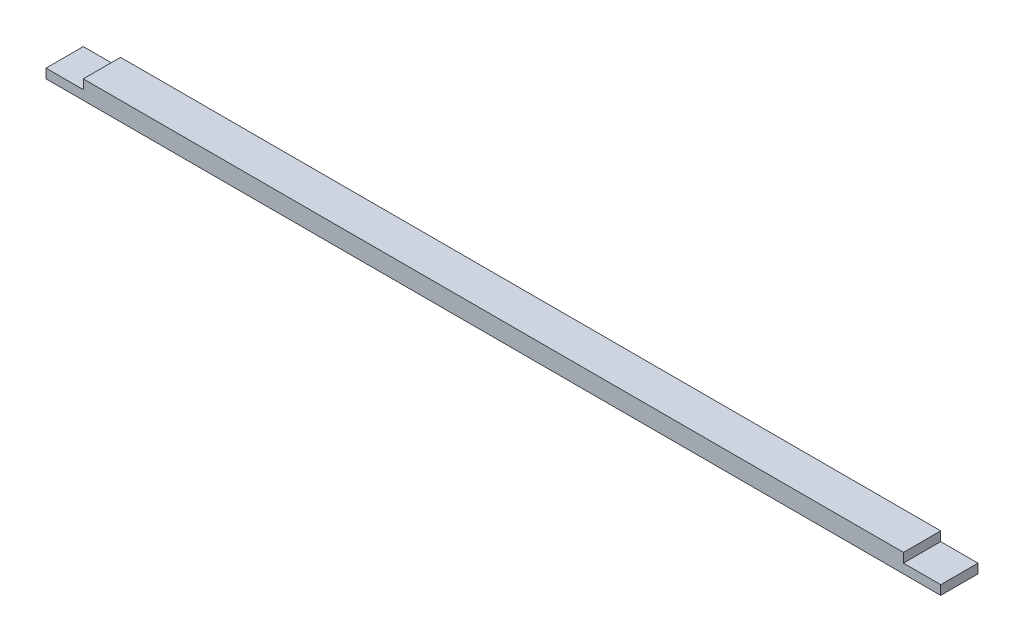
ISO-10303-21;
HEADER;
FILE_DESCRIPTION(('STEP AP214'),'2;1');
FILE_NAME('part.step','',(''),(''),'','','');
FILE_SCHEMA(('AUTOMOTIVE_DESIGN { 1 0 10303 214 1 1 1 1 }'));
ENDSEC;
DATA;
#1=APPLICATION_CONTEXT('core data for automotive mechanical design processes');
#2=APPLICATION_PROTOCOL_DEFINITION('international standard','automotive_design',2000,#1);
#3=PRODUCT_CONTEXT('',#1,'mechanical');
#4=PRODUCT('Part','Part','',(#3));
#5=PRODUCT_RELATED_PRODUCT_CATEGORY('part','',(#4));
#6=PRODUCT_DEFINITION_FORMATION('','',#4);
#7=PRODUCT_DEFINITION_CONTEXT('part definition',#1,'design');
#8=PRODUCT_DEFINITION('design','',#6,#7);
#9=PRODUCT_DEFINITION_SHAPE('','',#8);
#10=(LENGTH_UNIT() NAMED_UNIT(*) SI_UNIT(.MILLI.,.METRE.));
#11=(NAMED_UNIT(*) PLANE_ANGLE_UNIT() SI_UNIT($,.RADIAN.));
#12=(NAMED_UNIT(*) SI_UNIT($,.STERADIAN.) SOLID_ANGLE_UNIT());
#13=UNCERTAINTY_MEASURE_WITH_UNIT(LENGTH_MEASURE(1.E-05),#10,'distance_accuracy_value','');
#14=(GEOMETRIC_REPRESENTATION_CONTEXT(3) GLOBAL_UNCERTAINTY_ASSIGNED_CONTEXT((#13)) GLOBAL_UNIT_ASSIGNED_CONTEXT((#10,
#11,#12)) REPRESENTATION_CONTEXT('',''));
#15=CARTESIAN_POINT('',(0.,0.,0.));
#16=DIRECTION('',(0.,0.,1.));
#17=DIRECTION('',(1.,0.,0.));
#18=AXIS2_PLACEMENT_3D('',#15,#16,#17);
#19=CARTESIAN_POINT('',(-1219.2,50.8,1168.4));
#20=DIRECTION('',(0.,0.,1.));
#21=DIRECTION('',(1.,0.,0.));
#22=AXIS2_PLACEMENT_3D('',#19,#20,#21);
#23=PLANE('',#22);
#24=DIRECTION('',(0.,1.,0.));
#25=VECTOR('',#24,1.);
#26=CARTESIAN_POINT('',(-1117.6,25.4,1168.4));
#27=LINE('',#26,#25);
#28=CARTESIAN_POINT('',(-1117.6,25.4,1168.4));
#29=VERTEX_POINT('',#28);
#30=CARTESIAN_POINT('',(-1117.6,50.8,1168.4));
#31=VERTEX_POINT('',#30);
#32=EDGE_CURVE('E169',#29,#31,#27,.T.);
#33=ORIENTED_EDGE('',*,*,#32,.T.);
#34=DIRECTION('',(-1.,0.,0.));
#35=VECTOR('',#34,1.);
#36=CARTESIAN_POINT('',(-1219.2,50.8,1168.4));
#37=LINE('',#36,#35);
#38=CARTESIAN_POINT('',(1117.6,50.8,1168.4));
#39=VERTEX_POINT('',#38);
#40=EDGE_CURVE('E142',#39,#31,#37,.T.);
#41=ORIENTED_EDGE('',*,*,#40,.F.);
#42=DIRECTION('',(0.,1.,0.));
#43=VECTOR('',#42,1.);
#44=CARTESIAN_POINT('',(1117.6,25.4,1168.4));
#45=LINE('',#44,#43);
#46=CARTESIAN_POINT('',(1117.6,25.4,1168.4));
#47=VERTEX_POINT('',#46);
#48=EDGE_CURVE('E63',#47,#39,#45,.T.);
#49=ORIENTED_EDGE('',*,*,#48,.F.);
#50=DIRECTION('',(-1.,0.,0.));
#51=VECTOR('',#50,1.);
#52=CARTESIAN_POINT('',(1219.2,25.4,1168.4));
#53=LINE('',#52,#51);
#54=CARTESIAN_POINT('',(1219.2,25.4,1168.4));
#55=VERTEX_POINT('',#54);
#56=EDGE_CURVE('E176',#55,#47,#53,.T.);
#57=ORIENTED_EDGE('',*,*,#56,.F.);
#58=DIRECTION('',(0.,-1.,0.));
#59=VECTOR('',#58,1.);
#60=CARTESIAN_POINT('',(1219.2,50.8,1168.4));
#61=LINE('',#60,#59);
#62=CARTESIAN_POINT('',(1219.2,0.,1168.4));
#63=VERTEX_POINT('',#62);
#64=EDGE_CURVE('E11',#55,#63,#61,.T.);
#65=ORIENTED_EDGE('',*,*,#64,.T.);
#66=DIRECTION('',(-1.,0.,0.));
#67=VECTOR('',#66,1.);
#68=CARTESIAN_POINT('',(-1219.2,0.,1168.4));
#69=LINE('',#68,#67);
#70=CARTESIAN_POINT('',(-1219.2,0.,1168.4));
#71=VERTEX_POINT('',#70);
#72=EDGE_CURVE('E145',#63,#71,#69,.T.);
#73=ORIENTED_EDGE('',*,*,#72,.T.);
#74=DIRECTION('',(0.,-1.,0.));
#75=VECTOR('',#74,1.);
#76=CARTESIAN_POINT('',(-1219.2,50.8,1168.4));
#77=LINE('',#76,#75);
#78=CARTESIAN_POINT('',(-1219.2,25.4,1168.4));
#79=VERTEX_POINT('',#78);
#80=EDGE_CURVE('E48',#79,#71,#77,.T.);
#81=ORIENTED_EDGE('',*,*,#80,.F.);
#82=DIRECTION('',(1.,0.,0.));
#83=VECTOR('',#82,1.);
#84=CARTESIAN_POINT('',(-1219.2,25.4,1168.4));
#85=LINE('',#84,#83);
#86=EDGE_CURVE('E111',#79,#29,#85,.T.);
#87=ORIENTED_EDGE('',*,*,#86,.T.);
#88=EDGE_LOOP('',(#33,#41,#49,#57,#65,#73,#81,#87));
#89=FACE_BOUND('',#88,.T.);
#90=ADVANCED_FACE('F39',(#89),#23,.F.);
#91=CARTESIAN_POINT('',(-1219.2,50.8,1168.4));
#92=DIRECTION('',(1.,0.,0.));
#93=DIRECTION('',(0.,0.,-1.));
#94=AXIS2_PLACEMENT_3D('',#91,#92,#93);
#95=PLANE('',#94);
#96=DIRECTION('',(0.,0.,-1.));
#97=VECTOR('',#96,1.);
#98=CARTESIAN_POINT('',(-1219.2,25.4,1270.));
#99=LINE('',#98,#97);
#100=CARTESIAN_POINT('',(-1219.2,25.4,1270.));
#101=VERTEX_POINT('',#100);
#102=EDGE_CURVE('E105',#101,#79,#99,.T.);
#103=ORIENTED_EDGE('',*,*,#102,.T.);
#104=ORIENTED_EDGE('',*,*,#80,.T.);
#105=DIRECTION('',(0.,0.,1.));
#106=VECTOR('',#105,1.);
#107=CARTESIAN_POINT('',(-1219.2,0.,1168.4));
#108=LINE('',#107,#106);
#109=CARTESIAN_POINT('',(-1219.2,0.,1270.));
#110=VERTEX_POINT('',#109);
#111=EDGE_CURVE('E129',#71,#110,#108,.T.);
#112=ORIENTED_EDGE('',*,*,#111,.T.);
#113=DIRECTION('',(0.,-1.,0.));
#114=VECTOR('',#113,1.);
#115=CARTESIAN_POINT('',(-1219.2,50.8,1270.));
#116=LINE('',#115,#114);
#117=EDGE_CURVE('E121',#101,#110,#116,.T.);
#118=ORIENTED_EDGE('',*,*,#117,.F.);
#119=EDGE_LOOP('',(#103,#104,#112,#118));
#120=FACE_BOUND('',#119,.T.);
#121=ADVANCED_FACE('F127',(#120),#95,.F.);
#122=CARTESIAN_POINT('',(-1219.2,50.8,1270.));
#123=DIRECTION('',(0.,0.,-1.));
#124=DIRECTION('',(-1.,0.,0.));
#125=AXIS2_PLACEMENT_3D('',#122,#123,#124);
#126=PLANE('',#125);
#127=DIRECTION('',(0.,1.,0.));
#128=VECTOR('',#127,1.);
#129=CARTESIAN_POINT('',(-1117.6,25.4,1270.));
#130=LINE('',#129,#128);
#131=CARTESIAN_POINT('',(-1117.6,25.4,1270.));
#132=VERTEX_POINT('',#131);
#133=CARTESIAN_POINT('',(-1117.6,50.8,1270.));
#134=VERTEX_POINT('',#133);
#135=EDGE_CURVE('E55',#132,#134,#130,.T.);
#136=ORIENTED_EDGE('',*,*,#135,.F.);
#137=DIRECTION('',(-1.,0.,0.));
#138=VECTOR('',#137,1.);
#139=CARTESIAN_POINT('',(-1219.2,25.4,1270.));
#140=LINE('',#139,#138);
#141=EDGE_CURVE('E109',#132,#101,#140,.T.);
#142=ORIENTED_EDGE('',*,*,#141,.T.);
#143=ORIENTED_EDGE('',*,*,#117,.T.);
#144=DIRECTION('',(1.,0.,0.));
#145=VECTOR('',#144,1.);
#146=CARTESIAN_POINT('',(-1219.2,0.,1270.));
#147=LINE('',#146,#145);
#148=CARTESIAN_POINT('',(1219.2,0.,1270.));
#149=VERTEX_POINT('',#148);
#150=EDGE_CURVE('E139',#110,#149,#147,.T.);
#151=ORIENTED_EDGE('',*,*,#150,.T.);
#152=DIRECTION('',(0.,-1.,0.));
#153=VECTOR('',#152,1.);
#154=CARTESIAN_POINT('',(1219.2,50.8,1270.));
#155=LINE('',#154,#153);
#156=CARTESIAN_POINT('',(1219.2,25.4,1270.));
#157=VERTEX_POINT('',#156);
#158=EDGE_CURVE('E132',#157,#149,#155,.T.);
#159=ORIENTED_EDGE('',*,*,#158,.F.);
#160=DIRECTION('',(1.,0.,0.));
#161=VECTOR('',#160,1.);
#162=CARTESIAN_POINT('',(1219.2,25.4,1270.));
#163=LINE('',#162,#161);
#164=CARTESIAN_POINT('',(1117.6,25.4,1270.));
#165=VERTEX_POINT('',#164);
#166=EDGE_CURVE('E161',#165,#157,#163,.T.);
#167=ORIENTED_EDGE('',*,*,#166,.F.);
#168=DIRECTION('',(0.,1.,0.));
#169=VECTOR('',#168,1.);
#170=CARTESIAN_POINT('',(1117.6,25.4,1270.));
#171=LINE('',#170,#169);
#172=CARTESIAN_POINT('',(1117.6,50.8,1270.));
#173=VERTEX_POINT('',#172);
#174=EDGE_CURVE('E153',#165,#173,#171,.T.);
#175=ORIENTED_EDGE('',*,*,#174,.T.);
#176=DIRECTION('',(1.,0.,0.));
#177=VECTOR('',#176,1.);
#178=CARTESIAN_POINT('',(-1219.2,50.8,1270.));
#179=LINE('',#178,#177);
#180=EDGE_CURVE('E136',#134,#173,#179,.T.);
#181=ORIENTED_EDGE('',*,*,#180,.F.);
#182=EDGE_LOOP('',(#136,#142,#143,#151,#159,#167,#175,#181));
#183=FACE_BOUND('',#182,.T.);
#184=ADVANCED_FACE('F119',(#183),#126,.F.);
#185=CARTESIAN_POINT('',(0.,50.8,0.));
#186=DIRECTION('',(0.,1.,0.));
#187=DIRECTION('',(0.,0.,1.));
#188=AXIS2_PLACEMENT_3D('',#185,#186,#187);
#189=PLANE('',#188);
#190=ORIENTED_EDGE('',*,*,#40,.T.);
#191=DIRECTION('',(0.,0.,1.));
#192=VECTOR('',#191,1.);
#193=CARTESIAN_POINT('',(-1117.6,50.8,1270.));
#194=LINE('',#193,#192);
#195=EDGE_CURVE('E116',#31,#134,#194,.T.);
#196=ORIENTED_EDGE('',*,*,#195,.T.);
#197=ORIENTED_EDGE('',*,*,#180,.T.);
#198=DIRECTION('',(0.,0.,1.));
#199=VECTOR('',#198,1.);
#200=CARTESIAN_POINT('',(1117.6,50.8,1270.));
#201=LINE('',#200,#199);
#202=EDGE_CURVE('E165',#39,#173,#201,.T.);
#203=ORIENTED_EDGE('',*,*,#202,.F.);
#204=EDGE_LOOP('',(#190,#196,#197,#203));
#205=FACE_BOUND('',#204,.T.);
#206=ADVANCED_FACE('F208',(#205),#189,.T.);
#207=CARTESIAN_POINT('',(1219.2,50.8,1168.4));
#208=DIRECTION('',(-1.,0.,0.));
#209=DIRECTION('',(0.,0.,1.));
#210=AXIS2_PLACEMENT_3D('',#207,#208,#209);
#211=PLANE('',#210);
#212=DIRECTION('',(0.,0.,-1.));
#213=VECTOR('',#212,1.);
#214=CARTESIAN_POINT('',(1219.2,25.4,1270.));
#215=LINE('',#214,#213);
#216=EDGE_CURVE('E168',#157,#55,#215,.T.);
#217=ORIENTED_EDGE('',*,*,#216,.F.);
#218=ORIENTED_EDGE('',*,*,#158,.T.);
#219=DIRECTION('',(0.,0.,-1.));
#220=VECTOR('',#219,1.);
#221=CARTESIAN_POINT('',(1219.2,0.,1168.4));
#222=LINE('',#221,#220);
#223=EDGE_CURVE('E149',#149,#63,#222,.T.);
#224=ORIENTED_EDGE('',*,*,#223,.T.);
#225=ORIENTED_EDGE('',*,*,#64,.F.);
#226=EDGE_LOOP('',(#217,#218,#224,#225));
#227=FACE_BOUND('',#226,.T.);
#228=ADVANCED_FACE('F41',(#227),#211,.F.);
#229=CARTESIAN_POINT('',(0.,0.,0.));
#230=DIRECTION('',(0.,1.,0.));
#231=DIRECTION('',(0.,0.,1.));
#232=AXIS2_PLACEMENT_3D('',#229,#230,#231);
#233=PLANE('',#232);
#234=ORIENTED_EDGE('',*,*,#223,.F.);
#235=ORIENTED_EDGE('',*,*,#150,.F.);
#236=ORIENTED_EDGE('',*,*,#111,.F.);
#237=ORIENTED_EDGE('',*,*,#72,.F.);
#238=EDGE_LOOP('',(#234,#235,#236,#237));
#239=FACE_BOUND('',#238,.T.);
#240=ADVANCED_FACE('F200',(#239),#233,.F.);
#241=CARTESIAN_POINT('',(1117.6,25.4,1270.));
#242=DIRECTION('',(-1.,0.,0.));
#243=DIRECTION('',(0.,0.,1.));
#244=AXIS2_PLACEMENT_3D('',#241,#242,#243);
#245=PLANE('',#244);
#246=ORIENTED_EDGE('',*,*,#202,.T.);
#247=ORIENTED_EDGE('',*,*,#174,.F.);
#248=DIRECTION('',(0.,0.,1.));
#249=VECTOR('',#248,1.);
#250=CARTESIAN_POINT('',(1117.6,25.4,1270.));
#251=LINE('',#250,#249);
#252=EDGE_CURVE('E172',#47,#165,#251,.T.);
#253=ORIENTED_EDGE('',*,*,#252,.F.);
#254=ORIENTED_EDGE('',*,*,#48,.T.);
#255=EDGE_LOOP('',(#246,#247,#253,#254));
#256=FACE_BOUND('',#255,.T.);
#257=ADVANCED_FACE('F209',(#256),#245,.F.);
#258=CARTESIAN_POINT('',(0.,25.4,0.));
#259=DIRECTION('',(0.,1.,0.));
#260=DIRECTION('',(0.,0.,1.));
#261=AXIS2_PLACEMENT_3D('',#258,#259,#260);
#262=PLANE('',#261);
#263=ORIENTED_EDGE('',*,*,#216,.T.);
#264=ORIENTED_EDGE('',*,*,#56,.T.);
#265=ORIENTED_EDGE('',*,*,#252,.T.);
#266=ORIENTED_EDGE('',*,*,#166,.T.);
#267=EDGE_LOOP('',(#263,#264,#265,#266));
#268=FACE_BOUND('',#267,.T.);
#269=ADVANCED_FACE('F206',(#268),#262,.T.);
#270=CARTESIAN_POINT('',(-1117.6,25.4,1270.));
#271=DIRECTION('',(-1.,0.,0.));
#272=DIRECTION('',(0.,0.,1.));
#273=AXIS2_PLACEMENT_3D('',#270,#271,#272);
#274=PLANE('',#273);
#275=ORIENTED_EDGE('',*,*,#195,.F.);
#276=ORIENTED_EDGE('',*,*,#32,.F.);
#277=DIRECTION('',(0.,0.,1.));
#278=VECTOR('',#277,1.);
#279=CARTESIAN_POINT('',(-1117.6,25.4,1270.));
#280=LINE('',#279,#278);
#281=EDGE_CURVE('E125',#29,#132,#280,.T.);
#282=ORIENTED_EDGE('',*,*,#281,.T.);
#283=ORIENTED_EDGE('',*,*,#135,.T.);
#284=EDGE_LOOP('',(#275,#276,#282,#283));
#285=FACE_BOUND('',#284,.T.);
#286=ADVANCED_FACE('F192',(#285),#274,.T.);
#287=CARTESIAN_POINT('',(0.,25.4,0.));
#288=DIRECTION('',(0.,1.,0.));
#289=DIRECTION('',(0.,0.,1.));
#290=AXIS2_PLACEMENT_3D('',#287,#288,#289);
#291=PLANE('',#290);
#292=ORIENTED_EDGE('',*,*,#102,.F.);
#293=ORIENTED_EDGE('',*,*,#141,.F.);
#294=ORIENTED_EDGE('',*,*,#281,.F.);
#295=ORIENTED_EDGE('',*,*,#86,.F.);
#296=EDGE_LOOP('',(#292,#293,#294,#295));
#297=FACE_BOUND('',#296,.T.);
#298=ADVANCED_FACE('F107',(#297),#291,.T.);
#299=CLOSED_SHELL('',(#90,#121,#184,#206,#228,#240,#257,#269,#286,#298));
#300=MANIFOLD_SOLID_BREP('B2',#299);
#301=ADVANCED_BREP_SHAPE_REPRESENTATION('',(#18,#300),#14);
#302=SHAPE_DEFINITION_REPRESENTATION(#9,#301);
ENDSEC;
END-ISO-10303-21;
